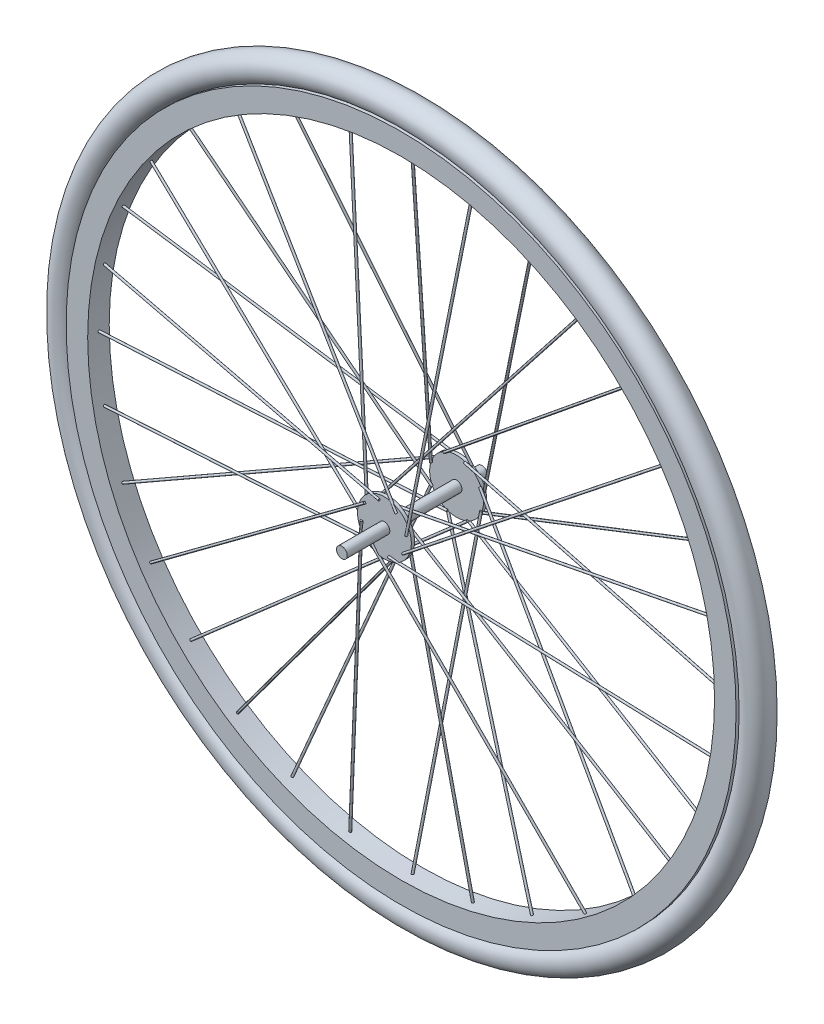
from build123d import *

# Parameters (mm, degrees)
SK_LLANTA_R            = 311
SK_LLANTA_R_2          = 291
LLANTA_DEPTH           = 10
CUBIERTA_PROFILE_R     = 12.5
EJE_PROFILE_R          = 5
PESTANA_IZQ_PROFILE_R  = 25
PESTANA_DCHA_PROFILE_R = 25
RADIO_IZQ_A_PROFILE_R  = 1
RADIO_IZQ_B_PROFILE_R  = 1
RADIO_DCHA_A_PROFILE_R = 1
RADIO_DCHA_B_PROFILE_R = 1
MATRIZ_RADIOS_COUNT    = 8


with BuildPart() as part:
    # Sk_Llanta → Llanta (new, symmetric)
    with BuildSketch(Plane.XY):
        with Locations((-425.1, 65)):
            Circle(SK_LLANTA_R)
        with Locations((-425.1, 65)):
            Circle(SK_LLANTA_R_2, mode=Mode.SUBTRACT)
    extrude(amount=LLANTA_DEPTH, both=True)

    # Cubierta: sweep along a path in Sk_Cubierta
    with BuildLine(Plane.XY) as cubierta_path:
        CenterArc((-425.1, 65), 321.5, 0, 360)
    # Cubierta profile (on start of the path) → Cubierta (sweep)
    with BuildSketch(Plane(origin=(-103.6, 65, 0), x_dir=(0, 0, 1), z_dir=(0, 1, 0))):
        Circle(CUBIERTA_PROFILE_R)
    sweep(path=cubierta_path.line)


with BuildPart() as body_2:
    # Eje: sweep along a curve in space
    with BuildLine() as eje_path:
        Line((-425.1, 65, -65), (-425.1, 65, 65))
    # Eje profile (on start of the path) → Eje (sweep)
    with BuildSketch(Plane(origin=(-425.1, 65, -65), x_dir=(1, 0, 0), z_dir=(0, 0, 1))):
        Circle(EJE_PROFILE_R)
    sweep(path=eje_path.line)

    # Pestana_izq: sweep along a curve in space
    with BuildLine() as pestana_izq_path:
        Line((-425.1, 65, -44.5), (-425.1, 65, -41.5))
    # Pestana_izq profile (on start of the path) → Pestana_izq (sweep)
    with BuildSketch(Plane(origin=(-425.1, 65, -44.5), x_dir=(1, 0, 0), z_dir=(0, 0, 1))):
        Circle(PESTANA_IZQ_PROFILE_R)
    sweep(path=pestana_izq_path.line)

    # Pestana_dcha: sweep along a curve in space
    with BuildLine() as pestana_dcha_path:
        Line((-425.1, 65, 22.5), (-425.1, 65, 25.5))
    # Pestana_dcha profile (on start of the path) → Pestana_dcha (sweep)
    with BuildSketch(Plane(origin=(-425.1, 65, 22.5), x_dir=(1, 0, 0), z_dir=(0, 0, 1))):
        Circle(PESTANA_DCHA_PROFILE_R)
    sweep(path=pestana_dcha_path.line)


with BuildPart() as body_3:
    # Radio_izq_a: sweep along a curve in space
    with BuildLine() as radio_izq_a_path:
        Line((-403.857500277, 65.242499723, -45), (-312.591070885, 336.620582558, 0))
    # Radio_izq_a profile (on start of the path) → Radio_izq_a (sweep)
    with BuildSketch(Plane(origin=(-403.857500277, 65.242499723, -45), x_dir=(0.9478342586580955, -0.31876357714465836, 0), z_dir=(0.31489792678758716, 0.9363398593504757, 0.1552641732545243))):
        Circle(RADIO_IZQ_A_PROFILE_R)
    sweep(path=radio_izq_a_path.line)


with BuildPart() as body_4:
    # Radio_izq_b: sweep along a curve in space
    with BuildLine() as radio_izq_b_path:
        Line((-402.918697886, 75.81618401, -41), (-217.210606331, -142.889393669, 0))
    # Radio_izq_b profile (on start of the path) → Radio_izq_b (sweep)
    with BuildSketch(Plane(origin=(-402.918697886, 75.81618401, -41), x_dir=(-0.7622688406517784, -0.647260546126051, 0), z_dir=(0.6407514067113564, -0.7546031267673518, 0.14146291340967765))):
        Circle(RADIO_IZQ_B_PROFILE_R)
    sweep(path=radio_izq_b_path.line)


with BuildPart() as body_5:
    # Radio_dcha_a: sweep along a curve in space
    with BuildLine() as radio_dcha_a_path:
        Line((-404.347677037, 69.252728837, 26), (-367.743445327, 353.350872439, 0))
    # Radio_dcha_a profile (on start of the path) → Radio_dcha_a (sweep)
    with BuildSketch(Plane(origin=(-404.347677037, 69.252728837, 26), x_dir=(0.9918015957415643, -0.12778730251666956, 0), z_dir=(0.1272641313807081, 0.9877410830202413, -0.09039576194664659))):
        Circle(RADIO_DCHA_A_PROFILE_R)
    sweep(path=radio_dcha_a_path.line)


with BuildPart() as body_6:
    # Radio_dcha_b: sweep along a curve in space
    with BuildLine() as radio_dcha_b_path:
        Line((-408.509413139, 75.796699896, 22), (-180.647933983, -98.337648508, 0))
    # Radio_dcha_b profile (on start of the path) → Radio_dcha_b (sweep)
    with BuildSketch(Plane(origin=(-408.509413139, 75.796699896, 22), x_dir=(0.6072021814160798, 0.7945473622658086, 0), z_dir=(0.7922196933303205, -0.6054233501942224, -0.07648872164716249))):
        Circle(RADIO_DCHA_B_PROFILE_R)
    sweep(path=radio_dcha_b_path.line)


with BuildPart() as matriz_radios_1:
    # Matriz_radios: pattern copy
    add(body_5.part.rotate(Axis((-425.1, 65, 0), (0, 0, 1)), 1 * 360 / MATRIZ_RADIOS_COUNT))


with BuildPart() as matriz_radios_2:
    # Matriz_radios: pattern copy
    add(body_5.part.rotate(Axis((-425.1, 65, 0), (0, 0, 1)), 2 * 360 / MATRIZ_RADIOS_COUNT))


with BuildPart() as matriz_radios_3:
    # Matriz_radios: pattern copy
    add(body_5.part.rotate(Axis((-425.1, 65, 0), (0, 0, 1)), 3 * 360 / MATRIZ_RADIOS_COUNT))


with BuildPart() as matriz_radios_4:
    # Matriz_radios: pattern copy
    add(body_5.part.rotate(Axis((-425.1, 65, 0), (0, 0, 1)), 4 * 360 / MATRIZ_RADIOS_COUNT))


with BuildPart() as matriz_radios_5:
    # Matriz_radios: pattern copy
    add(body_5.part.rotate(Axis((-425.1, 65, 0), (0, 0, 1)), 5 * 360 / MATRIZ_RADIOS_COUNT))


with BuildPart() as matriz_radios_6:
    # Matriz_radios: pattern copy
    add(body_5.part.rotate(Axis((-425.1, 65, 0), (0, 0, 1)), 6 * 360 / MATRIZ_RADIOS_COUNT))


with BuildPart() as matriz_radios_7:
    # Matriz_radios: pattern copy
    add(body_5.part.rotate(Axis((-425.1, 65, 0), (0, 0, 1)), 7 * 360 / MATRIZ_RADIOS_COUNT))


with BuildPart() as matriz_radios_8:
    # Matriz_radios: pattern copy
    add(body_6.part.rotate(Axis((-425.1, 65, 0), (0, 0, 1)), 1 * 360 / MATRIZ_RADIOS_COUNT))


with BuildPart() as matriz_radios_9:
    # Matriz_radios: pattern copy
    add(body_6.part.rotate(Axis((-425.1, 65, 0), (0, 0, 1)), 2 * 360 / MATRIZ_RADIOS_COUNT))


with BuildPart() as matriz_radios_10:
    # Matriz_radios: pattern copy
    add(body_6.part.rotate(Axis((-425.1, 65, 0), (0, 0, 1)), 3 * 360 / MATRIZ_RADIOS_COUNT))


with BuildPart() as matriz_radios_11:
    # Matriz_radios: pattern copy
    add(body_6.part.rotate(Axis((-425.1, 65, 0), (0, 0, 1)), 4 * 360 / MATRIZ_RADIOS_COUNT))


with BuildPart() as matriz_radios_12:
    # Matriz_radios: pattern copy
    add(body_6.part.rotate(Axis((-425.1, 65, 0), (0, 0, 1)), 5 * 360 / MATRIZ_RADIOS_COUNT))


with BuildPart() as matriz_radios_13:
    # Matriz_radios: pattern copy
    add(body_6.part.rotate(Axis((-425.1, 65, 0), (0, 0, 1)), 6 * 360 / MATRIZ_RADIOS_COUNT))


with BuildPart() as matriz_radios_14:
    # Matriz_radios: pattern copy
    add(body_6.part.rotate(Axis((-425.1, 65, 0), (0, 0, 1)), 7 * 360 / MATRIZ_RADIOS_COUNT))


with BuildPart() as matriz_radios_15:
    # Matriz_radios: pattern copy
    add(body_3.part.rotate(Axis((-425.1, 65, 0), (0, 0, 1)), 1 * 360 / MATRIZ_RADIOS_COUNT))


with BuildPart() as matriz_radios_16:
    # Matriz_radios: pattern copy
    add(body_3.part.rotate(Axis((-425.1, 65, 0), (0, 0, 1)), 2 * 360 / MATRIZ_RADIOS_COUNT))


with BuildPart() as matriz_radios_17:
    # Matriz_radios: pattern copy
    add(body_3.part.rotate(Axis((-425.1, 65, 0), (0, 0, 1)), 3 * 360 / MATRIZ_RADIOS_COUNT))


with BuildPart() as matriz_radios_18:
    # Matriz_radios: pattern copy
    add(body_3.part.rotate(Axis((-425.1, 65, 0), (0, 0, 1)), 4 * 360 / MATRIZ_RADIOS_COUNT))


with BuildPart() as matriz_radios_19:
    # Matriz_radios: pattern copy
    add(body_3.part.rotate(Axis((-425.1, 65, 0), (0, 0, 1)), 5 * 360 / MATRIZ_RADIOS_COUNT))


with BuildPart() as matriz_radios_20:
    # Matriz_radios: pattern copy
    add(body_3.part.rotate(Axis((-425.1, 65, 0), (0, 0, 1)), 6 * 360 / MATRIZ_RADIOS_COUNT))


with BuildPart() as matriz_radios_21:
    # Matriz_radios: pattern copy
    add(body_3.part.rotate(Axis((-425.1, 65, 0), (0, 0, 1)), 7 * 360 / MATRIZ_RADIOS_COUNT))


with BuildPart() as matriz_radios_22:
    # Matriz_radios: pattern copy
    add(body_4.part.rotate(Axis((-425.1, 65, 0), (0, 0, 1)), 1 * 360 / MATRIZ_RADIOS_COUNT))


with BuildPart() as matriz_radios_23:
    # Matriz_radios: pattern copy
    add(body_4.part.rotate(Axis((-425.1, 65, 0), (0, 0, 1)), 2 * 360 / MATRIZ_RADIOS_COUNT))


with BuildPart() as matriz_radios_24:
    # Matriz_radios: pattern copy
    add(body_4.part.rotate(Axis((-425.1, 65, 0), (0, 0, 1)), 3 * 360 / MATRIZ_RADIOS_COUNT))


with BuildPart() as matriz_radios_25:
    # Matriz_radios: pattern copy
    add(body_4.part.rotate(Axis((-425.1, 65, 0), (0, 0, 1)), 4 * 360 / MATRIZ_RADIOS_COUNT))


with BuildPart() as matriz_radios_26:
    # Matriz_radios: pattern copy
    add(body_4.part.rotate(Axis((-425.1, 65, 0), (0, 0, 1)), 5 * 360 / MATRIZ_RADIOS_COUNT))


with BuildPart() as matriz_radios_27:
    # Matriz_radios: pattern copy
    add(body_4.part.rotate(Axis((-425.1, 65, 0), (0, 0, 1)), 6 * 360 / MATRIZ_RADIOS_COUNT))


with BuildPart() as matriz_radios_28:
    # Matriz_radios: pattern copy
    add(body_4.part.rotate(Axis((-425.1, 65, 0), (0, 0, 1)), 7 * 360 / MATRIZ_RADIOS_COUNT))


solid = Compound([part.part, body_2.part, body_3.part, body_4.part, body_5.part, body_6.part, matriz_radios_1.part, matriz_radios_2.part, matriz_radios_3.part, matriz_radios_4.part, matriz_radios_5.part, matriz_radios_6.part, matriz_radios_7.part, matriz_radios_8.part, matriz_radios_9.part, matriz_radios_10.part, matriz_radios_11.part, matriz_radios_12.part, matriz_radios_13.part, matriz_radios_14.part, matriz_radios_15.part, matriz_radios_16.part, matriz_radios_17.part, matriz_radios_18.part, matriz_radios_19.part, matriz_radios_20.part, matriz_radios_21.part, matriz_radios_22.part, matriz_radios_23.part, matriz_radios_24.part, matriz_radios_25.part, matriz_radios_26.part, matriz_radios_27.part, matriz_radios_28.part])
